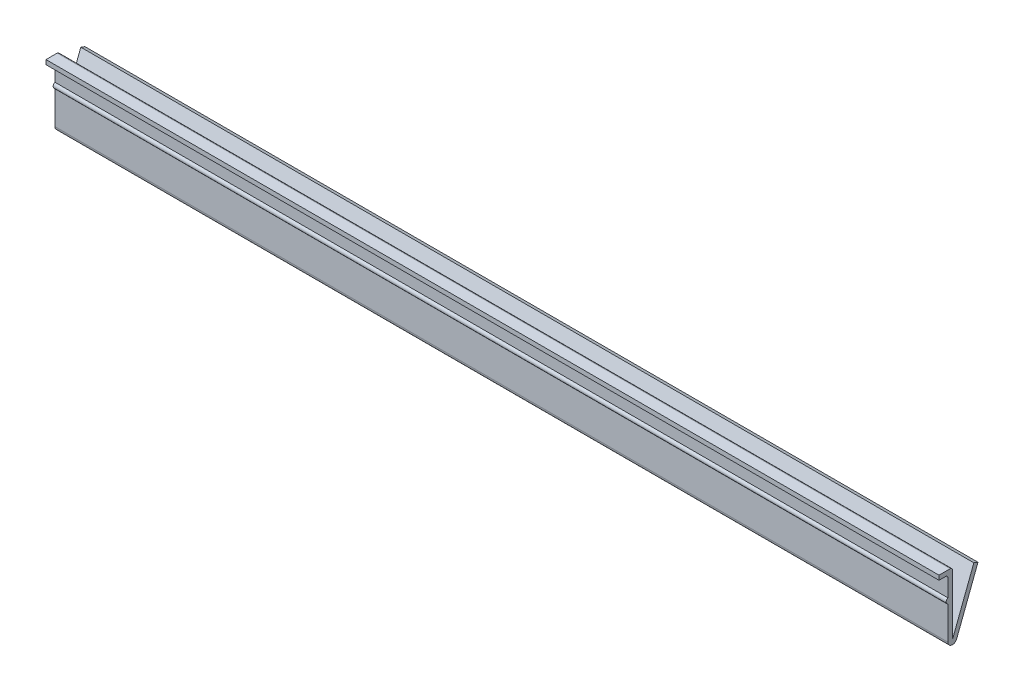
ISO-10303-21;
HEADER;
FILE_DESCRIPTION(('STEP AP214'),'2;1');
FILE_NAME('part.step','',(''),(''),'','','');
FILE_SCHEMA(('AUTOMOTIVE_DESIGN { 1 0 10303 214 1 1 1 1 }'));
ENDSEC;
DATA;
#1=APPLICATION_CONTEXT('core data for automotive mechanical design processes');
#2=APPLICATION_PROTOCOL_DEFINITION('international standard','automotive_design',2000,#1);
#3=PRODUCT_CONTEXT('',#1,'mechanical');
#4=PRODUCT('Part','Part','',(#3));
#5=PRODUCT_RELATED_PRODUCT_CATEGORY('part','',(#4));
#6=PRODUCT_DEFINITION_FORMATION('','',#4);
#7=PRODUCT_DEFINITION_CONTEXT('part definition',#1,'design');
#8=PRODUCT_DEFINITION('design','',#6,#7);
#9=PRODUCT_DEFINITION_SHAPE('','',#8);
#10=(LENGTH_UNIT() NAMED_UNIT(*) SI_UNIT(.MILLI.,.METRE.));
#11=(NAMED_UNIT(*) PLANE_ANGLE_UNIT() SI_UNIT($,.RADIAN.));
#12=(NAMED_UNIT(*) SI_UNIT($,.STERADIAN.) SOLID_ANGLE_UNIT());
#13=UNCERTAINTY_MEASURE_WITH_UNIT(LENGTH_MEASURE(1.E-05),#10,'distance_accuracy_value','');
#14=(GEOMETRIC_REPRESENTATION_CONTEXT(3) GLOBAL_UNCERTAINTY_ASSIGNED_CONTEXT((#13)) GLOBAL_UNIT_ASSIGNED_CONTEXT((#10,
#11,#12)) REPRESENTATION_CONTEXT('',''));
#15=CARTESIAN_POINT('',(0.,0.,0.));
#16=DIRECTION('',(0.,0.,1.));
#17=DIRECTION('',(1.,0.,0.));
#18=AXIS2_PLACEMENT_3D('',#15,#16,#17);
#19=CARTESIAN_POINT('',(200.,10.1176203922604,5.03115296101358));
#20=DIRECTION('',(0.,0.,-1.));
#21=DIRECTION('',(-1.,0.,0.));
#22=AXIS2_PLACEMENT_3D('',#19,#20,#21);
#23=PLANE('',#22);
#24=DIRECTION('',(0.,-1.,0.));
#25=VECTOR('',#24,1.);
#26=CARTESIAN_POINT('',(0.,10.1176203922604,5.03115296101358));
#27=LINE('',#26,#25);
#28=CARTESIAN_POINT('',(0.,10.1176203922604,5.03115296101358));
#29=VERTEX_POINT('',#28);
#30=CARTESIAN_POINT('',(0.,9.11762039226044,5.03115296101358));
#31=VERTEX_POINT('',#30);
#32=EDGE_CURVE('E229',#29,#31,#27,.T.);
#33=ORIENTED_EDGE('',*,*,#32,.T.);
#34=DIRECTION('',(-1.,0.,0.));
#35=VECTOR('',#34,1.);
#36=CARTESIAN_POINT('',(200.,9.11762039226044,5.03115296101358));
#37=LINE('',#36,#35);
#38=CARTESIAN_POINT('',(200.,9.11762039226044,5.03115296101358));
#39=VERTEX_POINT('',#38);
#40=EDGE_CURVE('E13',#39,#31,#37,.T.);
#41=ORIENTED_EDGE('',*,*,#40,.F.);
#42=DIRECTION('',(0.,-1.,0.));
#43=VECTOR('',#42,1.);
#44=CARTESIAN_POINT('',(200.,10.1176203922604,5.03115296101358));
#45=LINE('',#44,#43);
#46=CARTESIAN_POINT('',(200.,10.1176203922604,5.03115296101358));
#47=VERTEX_POINT('',#46);
#48=EDGE_CURVE('E269',#47,#39,#45,.T.);
#49=ORIENTED_EDGE('',*,*,#48,.F.);
#50=DIRECTION('',(-1.,0.,0.));
#51=VECTOR('',#50,1.);
#52=CARTESIAN_POINT('',(200.,10.1176203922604,5.03115296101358));
#53=LINE('',#52,#51);
#54=EDGE_CURVE('E225',#47,#29,#53,.T.);
#55=ORIENTED_EDGE('',*,*,#54,.T.);
#56=EDGE_LOOP('',(#33,#41,#49,#55));
#57=FACE_BOUND('',#56,.T.);
#58=ADVANCED_FACE('F92',(#57),#23,.F.);
#59=CARTESIAN_POINT('',(200.,9.11762039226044,5.03115296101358));
#60=DIRECTION('',(0.,1.,0.));
#61=DIRECTION('',(0.,0.,1.));
#62=AXIS2_PLACEMENT_3D('',#59,#60,#61);
#63=PLANE('',#62);
#64=DIRECTION('',(0.,0.,-1.));
#65=VECTOR('',#64,1.);
#66=CARTESIAN_POINT('',(0.,9.11762039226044,5.03115296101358));
#67=LINE('',#66,#65);
#68=CARTESIAN_POINT('',(0.,9.11762039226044,3.53115296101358));
#69=VERTEX_POINT('',#68);
#70=EDGE_CURVE('E233',#31,#69,#67,.T.);
#71=ORIENTED_EDGE('',*,*,#70,.T.);
#72=DIRECTION('',(-1.,0.,0.));
#73=VECTOR('',#72,1.);
#74=CARTESIAN_POINT('',(200.,9.11762039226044,3.53115296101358));
#75=LINE('',#74,#73);
#76=CARTESIAN_POINT('',(200.,9.11762039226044,3.53115296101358));
#77=VERTEX_POINT('',#76);
#78=EDGE_CURVE('E101',#77,#69,#75,.T.);
#79=ORIENTED_EDGE('',*,*,#78,.F.);
#80=DIRECTION('',(0.,0.,-1.));
#81=VECTOR('',#80,1.);
#82=CARTESIAN_POINT('',(200.,9.11762039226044,5.03115296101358));
#83=LINE('',#82,#81);
#84=EDGE_CURVE('E170',#39,#77,#83,.T.);
#85=ORIENTED_EDGE('',*,*,#84,.F.);
#86=ORIENTED_EDGE('',*,*,#40,.T.);
#87=EDGE_LOOP('',(#71,#79,#85,#86));
#88=FACE_BOUND('',#87,.T.);
#89=ADVANCED_FACE('F377',(#88),#63,.F.);
#90=CARTESIAN_POINT('',(200.,8.61762039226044,3.53115296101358));
#91=DIRECTION('',(-1.,0.,0.));
#92=DIRECTION('',(0.,0.,1.));
#93=AXIS2_PLACEMENT_3D('',#90,#91,#92);
#94=CYLINDRICAL_SURFACE('',#93,0.5);
#95=CARTESIAN_POINT('',(0.,8.61762039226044,3.53115296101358));
#96=DIRECTION('',(-1.,0.,0.));
#97=DIRECTION('',(0.,0.,1.));
#98=AXIS2_PLACEMENT_3D('',#95,#96,#97);
#99=CIRCLE('',#98,0.5);
#100=CARTESIAN_POINT('',(0.,8.61762039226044,3.03115296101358));
#101=VERTEX_POINT('',#100);
#102=EDGE_CURVE('E236',#69,#101,#99,.T.);
#103=ORIENTED_EDGE('',*,*,#102,.T.);
#104=DIRECTION('',(-1.,0.,0.));
#105=VECTOR('',#104,1.);
#106=CARTESIAN_POINT('',(200.,8.61762039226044,3.03115296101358));
#107=LINE('',#106,#105);
#108=CARTESIAN_POINT('',(200.,8.61762039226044,3.03115296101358));
#109=VERTEX_POINT('',#108);
#110=EDGE_CURVE('E304',#109,#101,#107,.T.);
#111=ORIENTED_EDGE('',*,*,#110,.F.);
#112=CARTESIAN_POINT('',(200.,8.61762039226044,3.53115296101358));
#113=DIRECTION('',(-1.,0.,0.));
#114=DIRECTION('',(0.,0.,1.));
#115=AXIS2_PLACEMENT_3D('',#112,#113,#114);
#116=CIRCLE('',#115,0.5);
#117=EDGE_CURVE('E314',#77,#109,#116,.T.);
#118=ORIENTED_EDGE('',*,*,#117,.F.);
#119=ORIENTED_EDGE('',*,*,#78,.T.);
#120=EDGE_LOOP('',(#103,#111,#118,#119));
#121=FACE_BOUND('',#120,.T.);
#122=ADVANCED_FACE('F312',(#121),#94,.F.);
#123=CARTESIAN_POINT('',(200.,8.61762039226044,3.03115296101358));
#124=DIRECTION('',(0.,0.,-1.));
#125=DIRECTION('',(-1.,0.,0.));
#126=AXIS2_PLACEMENT_3D('',#123,#124,#125);
#127=PLANE('',#126);
#128=DIRECTION('',(0.,-1.,0.));
#129=VECTOR('',#128,1.);
#130=CARTESIAN_POINT('',(0.,8.61762039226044,3.03115296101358));
#131=LINE('',#130,#129);
#132=CARTESIAN_POINT('',(0.,4.71736327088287,3.03115296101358));
#133=VERTEX_POINT('',#132);
#134=EDGE_CURVE('E239',#101,#133,#131,.T.);
#135=ORIENTED_EDGE('',*,*,#134,.T.);
#136=DIRECTION('',(-1.,0.,0.));
#137=VECTOR('',#136,1.);
#138=CARTESIAN_POINT('',(200.,4.71736327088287,3.03115296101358));
#139=LINE('',#138,#137);
#140=CARTESIAN_POINT('',(200.,4.71736327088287,3.03115296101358));
#141=VERTEX_POINT('',#140);
#142=EDGE_CURVE('E300',#141,#133,#139,.T.);
#143=ORIENTED_EDGE('',*,*,#142,.F.);
#144=DIRECTION('',(0.,-1.,0.));
#145=VECTOR('',#144,1.);
#146=CARTESIAN_POINT('',(200.,8.61762039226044,3.03115296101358));
#147=LINE('',#146,#145);
#148=EDGE_CURVE('E333',#109,#141,#147,.T.);
#149=ORIENTED_EDGE('',*,*,#148,.F.);
#150=ORIENTED_EDGE('',*,*,#110,.T.);
#151=EDGE_LOOP('',(#135,#143,#149,#150));
#152=FACE_BOUND('',#151,.T.);
#153=ADVANCED_FACE('F323',(#152),#127,.F.);
#154=CARTESIAN_POINT('',(200.,4.11762039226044,2.78053676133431));
#155=DIRECTION('',(-1.,0.,0.));
#156=DIRECTION('',(0.,0.,1.));
#157=AXIS2_PLACEMENT_3D('',#154,#155,#156);
#158=CYLINDRICAL_SURFACE('',#157,0.65);
#159=CARTESIAN_POINT('',(0.,4.11762039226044,2.78053676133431));
#160=DIRECTION('',(1.,0.,0.));
#161=DIRECTION('',(0.,0.,-1.));
#162=AXIS2_PLACEMENT_3D('',#159,#160,#161);
#163=CIRCLE('',#162,0.65);
#164=CARTESIAN_POINT('',(0.,3.517877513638,3.03115296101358));
#165=VERTEX_POINT('',#164);
#166=EDGE_CURVE('E242',#133,#165,#163,.T.);
#167=ORIENTED_EDGE('',*,*,#166,.T.);
#168=DIRECTION('',(-1.,0.,0.));
#169=VECTOR('',#168,1.);
#170=CARTESIAN_POINT('',(200.,3.517877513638,3.03115296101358));
#171=LINE('',#170,#169);
#172=CARTESIAN_POINT('',(200.,3.517877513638,3.03115296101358));
#173=VERTEX_POINT('',#172);
#174=EDGE_CURVE('E296',#173,#165,#171,.T.);
#175=ORIENTED_EDGE('',*,*,#174,.F.);
#176=CARTESIAN_POINT('',(200.,4.11762039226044,2.78053676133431));
#177=DIRECTION('',(1.,0.,0.));
#178=DIRECTION('',(0.,0.,-1.));
#179=AXIS2_PLACEMENT_3D('',#176,#177,#178);
#180=CIRCLE('',#179,0.65);
#181=EDGE_CURVE('E329',#141,#173,#180,.T.);
#182=ORIENTED_EDGE('',*,*,#181,.F.);
#183=ORIENTED_EDGE('',*,*,#142,.T.);
#184=EDGE_LOOP('',(#167,#175,#182,#183));
#185=FACE_BOUND('',#184,.T.);
#186=ADVANCED_FACE('F327',(#185),#158,.T.);
#187=CARTESIAN_POINT('',(200.,3.517877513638,3.03115296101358));
#188=DIRECTION('',(0.,0.,-1.));
#189=DIRECTION('',(0.,1.,0.));
#190=AXIS2_PLACEMENT_3D('',#187,#188,#189);
#191=PLANE('',#190);
#192=DIRECTION('',(0.,-1.,0.));
#193=VECTOR('',#192,1.);
#194=CARTESIAN_POINT('',(0.,3.517877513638,3.03115296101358));
#195=LINE('',#194,#193);
#196=CARTESIAN_POINT('',(0.,-3.87608326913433,3.0311529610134));
#197=VERTEX_POINT('',#196);
#198=EDGE_CURVE('E245',#165,#197,#195,.T.);
#199=ORIENTED_EDGE('',*,*,#198,.T.);
#200=DIRECTION('',(-1.,0.,0.));
#201=VECTOR('',#200,1.);
#202=CARTESIAN_POINT('',(200.,-3.87608326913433,3.0311529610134));
#203=LINE('',#202,#201);
#204=CARTESIAN_POINT('',(200.,-3.87608326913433,3.0311529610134));
#205=VERTEX_POINT('',#204);
#206=EDGE_CURVE('E292',#205,#197,#203,.T.);
#207=ORIENTED_EDGE('',*,*,#206,.F.);
#208=DIRECTION('',(0.,-1.,0.));
#209=VECTOR('',#208,1.);
#210=CARTESIAN_POINT('',(200.,3.517877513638,3.03115296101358));
#211=LINE('',#210,#209);
#212=EDGE_CURVE('E332',#173,#205,#211,.T.);
#213=ORIENTED_EDGE('',*,*,#212,.F.);
#214=ORIENTED_EDGE('',*,*,#174,.T.);
#215=EDGE_LOOP('',(#199,#207,#213,#214));
#216=FACE_BOUND('',#215,.T.);
#217=ADVANCED_FACE('F390',(#216),#191,.F.);
#218=CARTESIAN_POINT('',(200.,-3.87608326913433,2.02475004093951));
#219=DIRECTION('',(-1.,0.,0.));
#220=DIRECTION('',(0.,0.,1.));
#221=AXIS2_PLACEMENT_3D('',#218,#219,#220);
#222=CYLINDRICAL_SURFACE('',#221,1.00640292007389);
#223=CARTESIAN_POINT('',(0.,-3.87608326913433,2.02475004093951));
#224=DIRECTION('',(1.,0.,0.));
#225=DIRECTION('',(0.,0.,-1.));
#226=AXIS2_PLACEMENT_3D('',#223,#224,#225);
#227=CIRCLE('',#226,1.00640292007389);
#228=CARTESIAN_POINT('',(0.,-4.2357198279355,1.08479877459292));
#229=VERTEX_POINT('',#228);
#230=EDGE_CURVE('E248',#197,#229,#227,.T.);
#231=ORIENTED_EDGE('',*,*,#230,.T.);
#232=DIRECTION('',(-1.,0.,0.));
#233=VECTOR('',#232,1.);
#234=CARTESIAN_POINT('',(200.,-4.2357198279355,1.08479877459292));
#235=LINE('',#234,#233);
#236=CARTESIAN_POINT('',(200.,-4.2357198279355,1.08479877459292));
#237=VERTEX_POINT('',#236);
#238=EDGE_CURVE('E288',#237,#229,#235,.T.);
#239=ORIENTED_EDGE('',*,*,#238,.F.);
#240=CARTESIAN_POINT('',(200.,-3.87608326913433,2.02475004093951));
#241=DIRECTION('',(1.,0.,0.));
#242=DIRECTION('',(0.,0.,-1.));
#243=AXIS2_PLACEMENT_3D('',#240,#241,#242);
#244=CIRCLE('',#243,1.00640292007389);
#245=EDGE_CURVE('E337',#205,#237,#244,.T.);
#246=ORIENTED_EDGE('',*,*,#245,.F.);
#247=ORIENTED_EDGE('',*,*,#206,.T.);
#248=EDGE_LOOP('',(#231,#239,#246,#247));
#249=FACE_BOUND('',#248,.T.);
#250=ADVANCED_FACE('F393',(#249),#222,.T.);
#251=CARTESIAN_POINT('',(200.,-4.2357198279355,1.08479877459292));
#252=DIRECTION('',(0.,0.357348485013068,0.933971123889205));
#253=DIRECTION('',(0.,-0.933971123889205,0.357348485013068));
#254=AXIS2_PLACEMENT_3D('',#251,#252,#253);
#255=PLANE('',#254);
#256=DIRECTION('',(0.,0.933971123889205,-0.357348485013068));
#257=VECTOR('',#256,1.);
#258=CARTESIAN_POINT('',(0.,-4.2357198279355,1.08479877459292));
#259=LINE('',#258,#257);
#260=CARTESIAN_POINT('',(0.,8.26027190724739,-3.69631661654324));
#261=VERTEX_POINT('',#260);
#262=EDGE_CURVE('E251',#229,#261,#259,.T.);
#263=ORIENTED_EDGE('',*,*,#262,.T.);
#264=DIRECTION('',(-1.,0.,0.));
#265=VECTOR('',#264,1.);
#266=CARTESIAN_POINT('',(200.,8.26027190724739,-3.69631661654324));
#267=LINE('',#266,#265);
#268=CARTESIAN_POINT('',(200.,8.26027190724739,-3.69631661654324));
#269=VERTEX_POINT('',#268);
#270=EDGE_CURVE('E284',#269,#261,#267,.T.);
#271=ORIENTED_EDGE('',*,*,#270,.F.);
#272=DIRECTION('',(0.,0.933971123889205,-0.357348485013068));
#273=VECTOR('',#272,1.);
#274=CARTESIAN_POINT('',(200.,-4.2357198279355,1.08479877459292));
#275=LINE('',#274,#273);
#276=EDGE_CURVE('E344',#237,#269,#275,.T.);
#277=ORIENTED_EDGE('',*,*,#276,.F.);
#278=ORIENTED_EDGE('',*,*,#238,.T.);
#279=EDGE_LOOP('',(#263,#271,#277,#278));
#280=FACE_BOUND('',#279,.T.);
#281=ADVANCED_FACE('F397',(#280),#255,.F.);
#282=CARTESIAN_POINT('',(200.,8.61762039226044,-2.76234549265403));
#283=DIRECTION('',(0.,-0.933971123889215,0.357348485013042));
#284=DIRECTION('',(0.,-0.357348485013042,-0.933971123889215));
#285=AXIS2_PLACEMENT_3D('',#282,#283,#284);
#286=PLANE('',#285);
#287=DIRECTION('',(0.,0.357348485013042,0.933971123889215));
#288=VECTOR('',#287,1.);
#289=CARTESIAN_POINT('',(0.,8.61762039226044,-2.76234549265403));
#290=LINE('',#289,#288);
#291=CARTESIAN_POINT('',(0.,8.61762039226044,-2.76234549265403));
#292=VERTEX_POINT('',#291);
#293=EDGE_CURVE('E254',#261,#292,#290,.T.);
#294=ORIENTED_EDGE('',*,*,#293,.T.);
#295=DIRECTION('',(-1.,0.,0.));
#296=VECTOR('',#295,1.);
#297=CARTESIAN_POINT('',(200.,8.61762039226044,-2.76234549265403));
#298=LINE('',#297,#296);
#299=CARTESIAN_POINT('',(200.,8.61762039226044,-2.76234549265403));
#300=VERTEX_POINT('',#299);
#301=EDGE_CURVE('E280',#300,#292,#298,.T.);
#302=ORIENTED_EDGE('',*,*,#301,.F.);
#303=DIRECTION('',(0.,0.357348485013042,0.933971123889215));
#304=VECTOR('',#303,1.);
#305=CARTESIAN_POINT('',(200.,8.61762039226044,-2.76234549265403));
#306=LINE('',#305,#304);
#307=EDGE_CURVE('E347',#269,#300,#306,.T.);
#308=ORIENTED_EDGE('',*,*,#307,.F.);
#309=ORIENTED_EDGE('',*,*,#270,.T.);
#310=EDGE_LOOP('',(#294,#302,#308,#309));
#311=FACE_BOUND('',#310,.T.);
#312=ADVANCED_FACE('F401',(#311),#286,.F.);
#313=CARTESIAN_POINT('',(200.,-3.87837134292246,2.01876989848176));
#314=DIRECTION('',(0.,-0.357348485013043,-0.933971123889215));
#315=DIRECTION('',(0.,0.933971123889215,-0.357348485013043));
#316=AXIS2_PLACEMENT_3D('',#313,#314,#315);
#317=PLANE('',#316);
#318=DIRECTION('',(0.,-0.933971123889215,0.357348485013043));
#319=VECTOR('',#318,1.);
#320=CARTESIAN_POINT('',(0.,-3.87837134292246,2.01876989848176));
#321=LINE('',#320,#319);
#322=CARTESIAN_POINT('',(0.,-3.87837134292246,2.01876989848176));
#323=VERTEX_POINT('',#322);
#324=EDGE_CURVE('E257',#292,#323,#321,.T.);
#325=ORIENTED_EDGE('',*,*,#324,.T.);
#326=DIRECTION('',(-1.,0.,0.));
#327=VECTOR('',#326,1.);
#328=CARTESIAN_POINT('',(200.,-3.87837134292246,2.01876989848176));
#329=LINE('',#328,#327);
#330=CARTESIAN_POINT('',(200.,-3.87837134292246,2.01876989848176));
#331=VERTEX_POINT('',#330);
#332=EDGE_CURVE('E276',#331,#323,#329,.T.);
#333=ORIENTED_EDGE('',*,*,#332,.F.);
#334=DIRECTION('',(0.,-0.933971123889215,0.357348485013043));
#335=VECTOR('',#334,1.);
#336=CARTESIAN_POINT('',(200.,-3.87837134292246,2.01876989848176));
#337=LINE('',#336,#335);
#338=EDGE_CURVE('E350',#300,#331,#337,.T.);
#339=ORIENTED_EDGE('',*,*,#338,.F.);
#340=ORIENTED_EDGE('',*,*,#301,.T.);
#341=EDGE_LOOP('',(#325,#333,#339,#340));
#342=FACE_BOUND('',#341,.T.);
#343=ADVANCED_FACE('F358',(#342),#317,.F.);
#344=CARTESIAN_POINT('',(200.,-3.87608326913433,2.02475004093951));
#345=DIRECTION('',(-1.,0.,0.));
#346=DIRECTION('',(0.,0.,1.));
#347=AXIS2_PLACEMENT_3D('',#344,#345,#346);
#348=CYLINDRICAL_SURFACE('',#347,0.00640292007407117);
#349=CARTESIAN_POINT('',(0.,-3.87608326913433,2.02475004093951));
#350=DIRECTION('',(-1.,0.,0.));
#351=DIRECTION('',(0.,0.,-1.));
#352=AXIS2_PLACEMENT_3D('',#349,#350,#351);
#353=CIRCLE('',#352,0.00640292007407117);
#354=CARTESIAN_POINT('',(0.,-3.87608326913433,2.03115296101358));
#355=VERTEX_POINT('',#354);
#356=EDGE_CURVE('E260',#323,#355,#353,.T.);
#357=ORIENTED_EDGE('',*,*,#356,.T.);
#358=DIRECTION('',(-1.,0.,0.));
#359=VECTOR('',#358,1.);
#360=CARTESIAN_POINT('',(200.,-3.87608326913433,2.03115296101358));
#361=LINE('',#360,#359);
#362=CARTESIAN_POINT('',(200.,-3.87608326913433,2.03115296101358));
#363=VERTEX_POINT('',#362);
#364=EDGE_CURVE('E218',#363,#355,#361,.T.);
#365=ORIENTED_EDGE('',*,*,#364,.F.);
#366=CARTESIAN_POINT('',(200.,-3.87608326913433,2.02475004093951));
#367=DIRECTION('',(-1.,0.,0.));
#368=DIRECTION('',(0.,0.,-1.));
#369=AXIS2_PLACEMENT_3D('',#366,#367,#368);
#370=CIRCLE('',#369,0.00640292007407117);
#371=EDGE_CURVE('E207',#331,#363,#370,.T.);
#372=ORIENTED_EDGE('',*,*,#371,.F.);
#373=ORIENTED_EDGE('',*,*,#332,.T.);
#374=EDGE_LOOP('',(#357,#365,#372,#373));
#375=FACE_BOUND('',#374,.T.);
#376=ADVANCED_FACE('F362',(#375),#348,.F.);
#377=CARTESIAN_POINT('',(200.,9.61762039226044,2.03115296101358));
#378=DIRECTION('',(0.,0.,1.));
#379=DIRECTION('',(0.,-1.,0.));
#380=AXIS2_PLACEMENT_3D('',#377,#378,#379);
#381=PLANE('',#380);
#382=DIRECTION('',(0.,1.,0.));
#383=VECTOR('',#382,1.);
#384=CARTESIAN_POINT('',(0.,9.61762039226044,2.03115296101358));
#385=LINE('',#384,#383);
#386=CARTESIAN_POINT('',(0.,9.61762039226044,2.03115296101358));
#387=VERTEX_POINT('',#386);
#388=EDGE_CURVE('E216',#355,#387,#385,.T.);
#389=ORIENTED_EDGE('',*,*,#388,.T.);
#390=DIRECTION('',(-1.,0.,0.));
#391=VECTOR('',#390,1.);
#392=CARTESIAN_POINT('',(200.,9.61762039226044,2.03115296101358));
#393=LINE('',#392,#391);
#394=CARTESIAN_POINT('',(200.,9.61762039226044,2.03115296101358));
#395=VERTEX_POINT('',#394);
#396=EDGE_CURVE('E213',#395,#387,#393,.T.);
#397=ORIENTED_EDGE('',*,*,#396,.F.);
#398=DIRECTION('',(0.,1.,0.));
#399=VECTOR('',#398,1.);
#400=CARTESIAN_POINT('',(200.,9.61762039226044,2.03115296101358));
#401=LINE('',#400,#399);
#402=EDGE_CURVE('E201',#363,#395,#401,.T.);
#403=ORIENTED_EDGE('',*,*,#402,.F.);
#404=ORIENTED_EDGE('',*,*,#364,.T.);
#405=EDGE_LOOP('',(#389,#397,#403,#404));
#406=FACE_BOUND('',#405,.T.);
#407=ADVANCED_FACE('F214',(#406),#381,.F.);
#408=CARTESIAN_POINT('',(200.,9.61762039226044,2.53115296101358));
#409=DIRECTION('',(-1.,0.,0.));
#410=DIRECTION('',(0.,0.,1.));
#411=AXIS2_PLACEMENT_3D('',#408,#409,#410);
#412=CYLINDRICAL_SURFACE('',#411,0.5);
#413=CARTESIAN_POINT('',(0.,9.61762039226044,2.53115296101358));
#414=DIRECTION('',(1.,0.,0.));
#415=DIRECTION('',(0.,0.,1.));
#416=AXIS2_PLACEMENT_3D('',#413,#414,#415);
#417=CIRCLE('',#416,0.5);
#418=CARTESIAN_POINT('',(0.,10.1176203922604,2.53115296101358));
#419=VERTEX_POINT('',#418);
#420=EDGE_CURVE('E156',#387,#419,#417,.T.);
#421=ORIENTED_EDGE('',*,*,#420,.T.);
#422=DIRECTION('',(-1.,0.,0.));
#423=VECTOR('',#422,1.);
#424=CARTESIAN_POINT('',(200.,10.1176203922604,2.53115296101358));
#425=LINE('',#424,#423);
#426=CARTESIAN_POINT('',(200.,10.1176203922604,2.53115296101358));
#427=VERTEX_POINT('',#426);
#428=EDGE_CURVE('E219',#427,#419,#425,.T.);
#429=ORIENTED_EDGE('',*,*,#428,.F.);
#430=CARTESIAN_POINT('',(200.,9.61762039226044,2.53115296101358));
#431=DIRECTION('',(1.,0.,0.));
#432=DIRECTION('',(0.,0.,1.));
#433=AXIS2_PLACEMENT_3D('',#430,#431,#432);
#434=CIRCLE('',#433,0.5);
#435=EDGE_CURVE('E205',#395,#427,#434,.T.);
#436=ORIENTED_EDGE('',*,*,#435,.F.);
#437=ORIENTED_EDGE('',*,*,#396,.T.);
#438=EDGE_LOOP('',(#421,#429,#436,#437));
#439=FACE_BOUND('',#438,.T.);
#440=ADVANCED_FACE('F221',(#439),#412,.T.);
#441=CARTESIAN_POINT('',(200.,10.1176203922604,5.03115296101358));
#442=DIRECTION('',(0.,-1.,0.));
#443=DIRECTION('',(0.,0.,-1.));
#444=AXIS2_PLACEMENT_3D('',#441,#442,#443);
#445=PLANE('',#444);
#446=DIRECTION('',(0.,0.,1.));
#447=VECTOR('',#446,1.);
#448=CARTESIAN_POINT('',(0.,10.1176203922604,5.03115296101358));
#449=LINE('',#448,#447);
#450=EDGE_CURVE('E162',#419,#29,#449,.T.);
#451=ORIENTED_EDGE('',*,*,#450,.T.);
#452=ORIENTED_EDGE('',*,*,#54,.F.);
#453=DIRECTION('',(0.,0.,1.));
#454=VECTOR('',#453,1.);
#455=CARTESIAN_POINT('',(200.,10.1176203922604,5.03115296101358));
#456=LINE('',#455,#454);
#457=EDGE_CURVE('E109',#427,#47,#456,.T.);
#458=ORIENTED_EDGE('',*,*,#457,.F.);
#459=ORIENTED_EDGE('',*,*,#428,.T.);
#460=EDGE_LOOP('',(#451,#452,#458,#459));
#461=FACE_BOUND('',#460,.T.);
#462=ADVANCED_FACE('F366',(#461),#445,.F.);
#463=CARTESIAN_POINT('',(200.,8.61762039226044,3.53115296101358));
#464=DIRECTION('',(-1.,0.,0.));
#465=DIRECTION('',(0.,0.,1.));
#466=AXIS2_PLACEMENT_3D('',#463,#464,#465);
#467=PLANE('',#466);
#468=ORIENTED_EDGE('',*,*,#48,.T.);
#469=ORIENTED_EDGE('',*,*,#84,.T.);
#470=ORIENTED_EDGE('',*,*,#117,.T.);
#471=ORIENTED_EDGE('',*,*,#148,.T.);
#472=ORIENTED_EDGE('',*,*,#181,.T.);
#473=ORIENTED_EDGE('',*,*,#212,.T.);
#474=ORIENTED_EDGE('',*,*,#245,.T.);
#475=ORIENTED_EDGE('',*,*,#276,.T.);
#476=ORIENTED_EDGE('',*,*,#307,.T.);
#477=ORIENTED_EDGE('',*,*,#338,.T.);
#478=ORIENTED_EDGE('',*,*,#371,.T.);
#479=ORIENTED_EDGE('',*,*,#402,.T.);
#480=ORIENTED_EDGE('',*,*,#435,.T.);
#481=ORIENTED_EDGE('',*,*,#457,.T.);
#482=EDGE_LOOP('',(#468,#469,#470,#471,#472,#473,#474,#475,#476,#477,#478,#479,#480,#481));
#483=FACE_BOUND('',#482,.T.);
#484=ADVANCED_FACE('F203',(#483),#467,.F.);
#485=CARTESIAN_POINT('',(0.,8.61762039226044,3.53115296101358));
#486=DIRECTION('',(-1.,0.,0.));
#487=DIRECTION('',(0.,0.,1.));
#488=AXIS2_PLACEMENT_3D('',#485,#486,#487);
#489=PLANE('',#488);
#490=ORIENTED_EDGE('',*,*,#32,.F.);
#491=ORIENTED_EDGE('',*,*,#450,.F.);
#492=ORIENTED_EDGE('',*,*,#420,.F.);
#493=ORIENTED_EDGE('',*,*,#388,.F.);
#494=ORIENTED_EDGE('',*,*,#356,.F.);
#495=ORIENTED_EDGE('',*,*,#324,.F.);
#496=ORIENTED_EDGE('',*,*,#293,.F.);
#497=ORIENTED_EDGE('',*,*,#262,.F.);
#498=ORIENTED_EDGE('',*,*,#230,.F.);
#499=ORIENTED_EDGE('',*,*,#198,.F.);
#500=ORIENTED_EDGE('',*,*,#166,.F.);
#501=ORIENTED_EDGE('',*,*,#134,.F.);
#502=ORIENTED_EDGE('',*,*,#102,.F.);
#503=ORIENTED_EDGE('',*,*,#70,.F.);
#504=EDGE_LOOP('',(#490,#491,#492,#493,#494,#495,#496,#497,#498,#499,#500,#501,#502,#503));
#505=FACE_BOUND('',#504,.T.);
#506=ADVANCED_FACE('F318',(#505),#489,.T.);
#507=CLOSED_SHELL('',(#58,#89,#122,#153,#186,#217,#250,#281,#312,#343,#376,#407,#440,#462,#484,#506));
#508=MANIFOLD_SOLID_BREP('B2',#507);
#509=ADVANCED_BREP_SHAPE_REPRESENTATION('',(#18,#508),#14);
#510=SHAPE_DEFINITION_REPRESENTATION(#9,#509);
ENDSEC;
END-ISO-10303-21;
